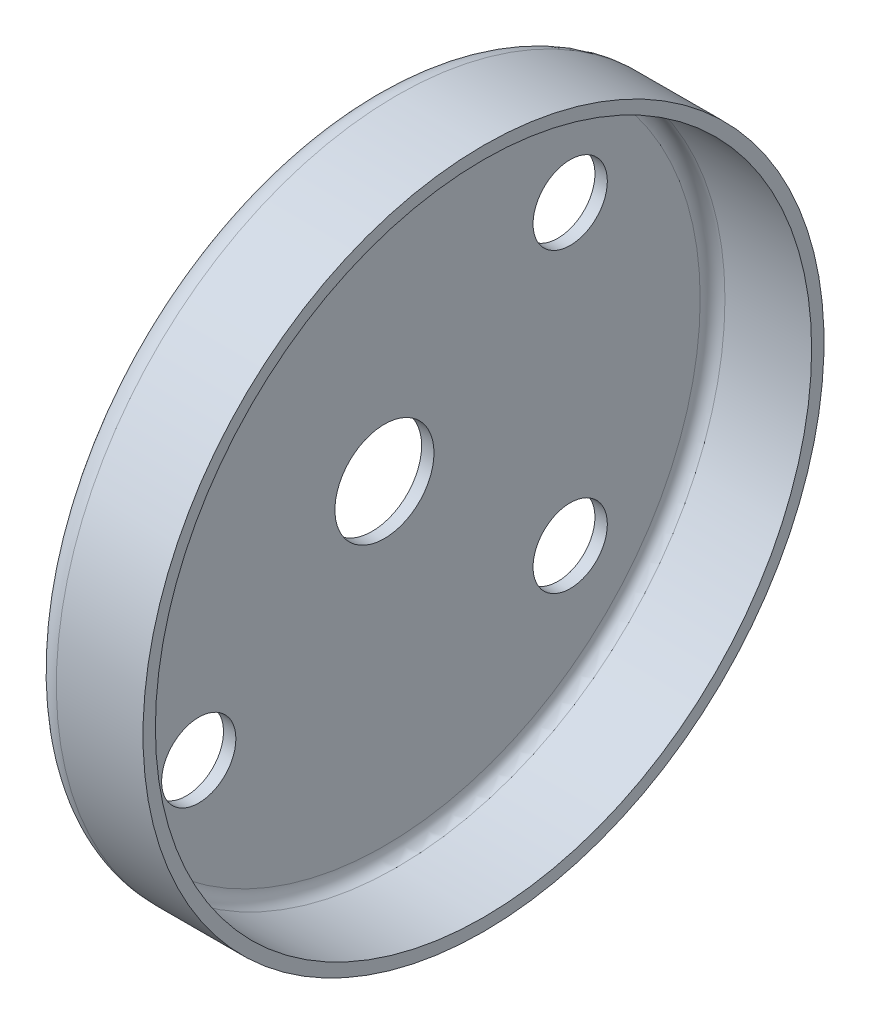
from build123d import *

# Parameters (mm, degrees)
SKETCH1_R               = 27.5
SKETCH1_R_2             = 4
SKETCH1_R_3             = 3
BOSS_EXTRUDE1_DEPTH     = 25
CUT_EXTRUDE2_DEPTH      = 47.233105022
CUT_EXTRUDE2_DEPTH_BACK = 47.233105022
FILLET2_R               = 2
SHELL4_T                = -1


with BuildPart() as part:
    # Sketch1 → Boss-Extrude1 (new body)
    with BuildSketch(Plane(origin=(0, 0, 0), x_dir=(0, 0, -1), z_dir=(1, 0, 0))):
        Circle(SKETCH1_R)
        Circle(SKETCH1_R_2, mode=Mode.SUBTRACT)
        with Locations((-15, 12)):
            Circle(SKETCH1_R_3, mode=Mode.SUBTRACT)
        with Locations(Location((-15, -12, 0), (0, 0, 180))):
            Circle(SKETCH1_R_3, mode=Mode.SUBTRACT)
        with Locations(Location((15, 12, 0), (0, 0, 180))):
            Circle(SKETCH1_R_3, mode=Mode.SUBTRACT)
        with Locations((15, -12)):
            Circle(SKETCH1_R_3, mode=Mode.SUBTRACT)
    extrude(amount=BOSS_EXTRUDE1_DEPTH)

    # Sketch4 → Cut-Extrude2 (cut, two sides: drawn at the far end of the back side and taken through both)
    with BuildSketch(Plane.XY.offset(-CUT_EXTRUDE2_DEPTH_BACK)):
        Polygon((9, 152.060027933), (9, 27.5), (9, -27.5), (9, -152.060027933), (258.120055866, -152.060027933), (258.120055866, 152.060027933), align=None)
    extrude(amount=CUT_EXTRUDE2_DEPTH + CUT_EXTRUDE2_DEPTH_BACK, mode=Mode.SUBTRACT)

    # Fillet2
    fillet2_edges = [part.edges().sort_by_distance(p)[0] for p in [
        (0, 0, 27.5),
    ]]
    fillet(fillet2_edges, radius=FILLET2_R)

    # Shell4
    shell4_openings = [part.faces().sort_by_distance(p)[0] for p in [
        (4.5, -12, -12),
        (4.5, 12, -18),
        (4.5, -12, 12),
        (4.5, 12, 18),
        (4.5, 0, 4),
        (9, 0, 26.722182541),
    ]]
    offset(amount=SHELL4_T, openings=shell4_openings, kind=Kind.INTERSECTION)


solid = part.part
